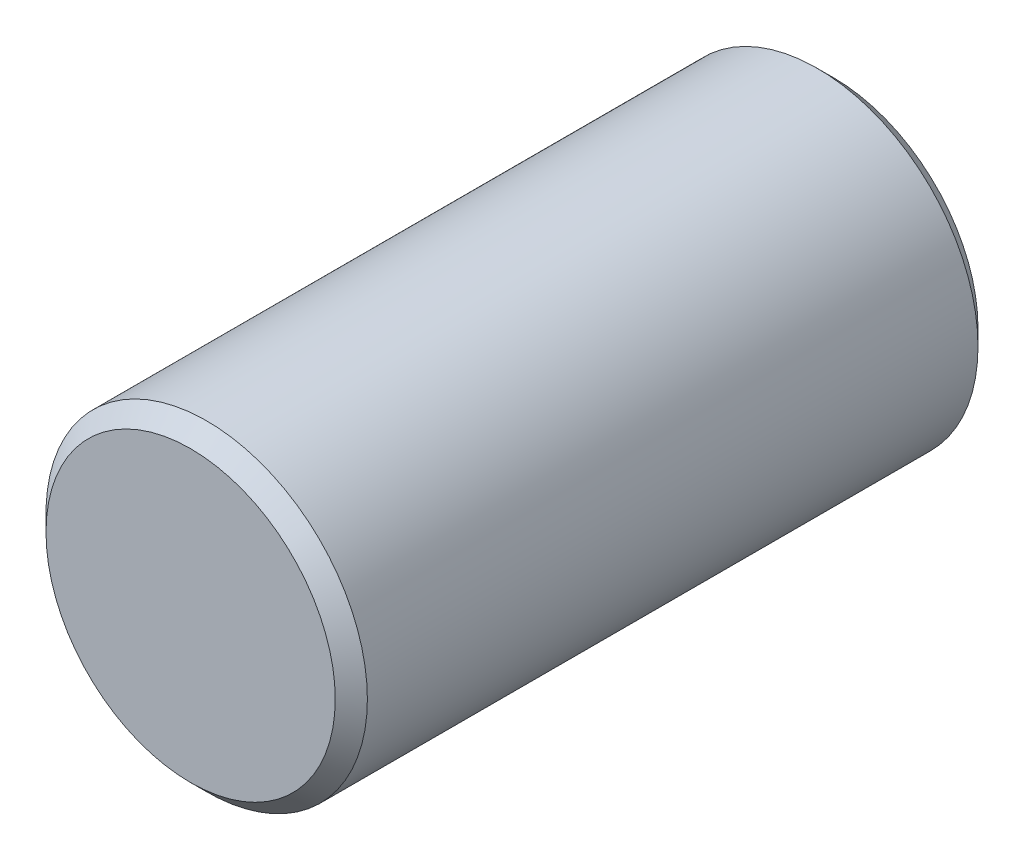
from build123d import *

# Parameters (mm, degrees)
ESQUISSE1_R            = 2
BASE_CYLINDRIQUE_DEPTH = 8
CHANFREINS_SIZE        = 0.2


with BuildPart() as part:
    # Esquisse1 → Base cylindrique (new body)
    with BuildSketch(Plane.XY):
        Circle(ESQUISSE1_R)
    extrude(amount=BASE_CYLINDRIQUE_DEPTH)

    # Chanfreins
    chanfreins_edges = [part.edges().sort_by_distance(p)[0] for p in [
        (-2, 0, 0),
        (-2, 0, 8),
    ]]
    chamfer(chanfreins_edges, length=CHANFREINS_SIZE)


solid = part.part
